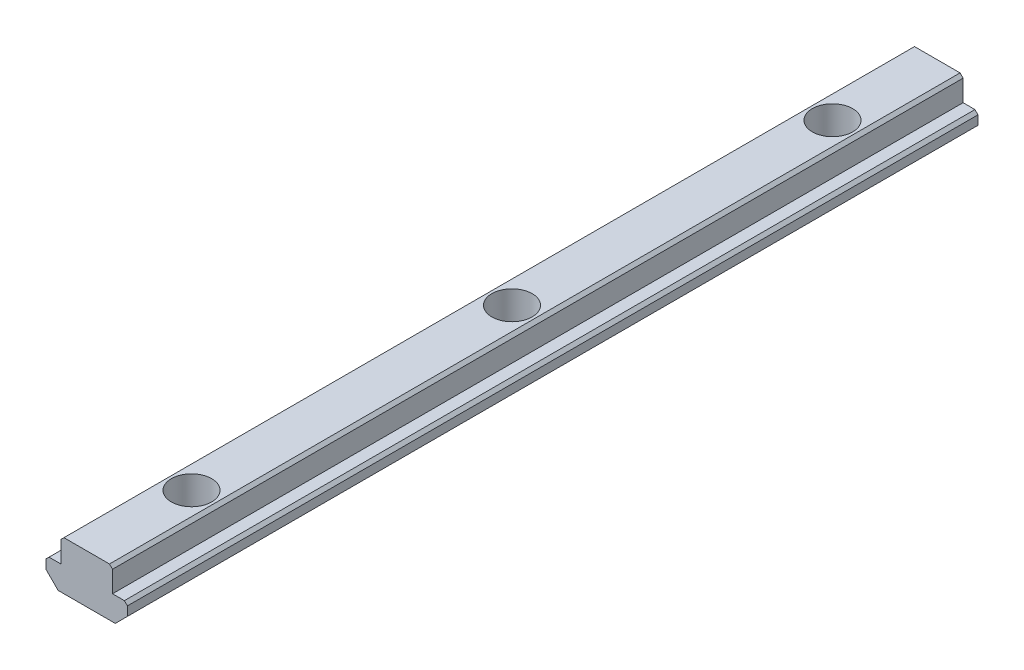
ISO-10303-21;
HEADER;
FILE_DESCRIPTION(('STEP AP214'),'2;1');
FILE_NAME('part.step','',(''),(''),'','','');
FILE_SCHEMA(('AUTOMOTIVE_DESIGN { 1 0 10303 214 1 1 1 1 }'));
ENDSEC;
DATA;
#1=APPLICATION_CONTEXT('core data for automotive mechanical design processes');
#2=APPLICATION_PROTOCOL_DEFINITION('international standard','automotive_design',2000,#1);
#3=PRODUCT_CONTEXT('',#1,'mechanical');
#4=PRODUCT('Part','Part','',(#3));
#5=PRODUCT_RELATED_PRODUCT_CATEGORY('part','',(#4));
#6=PRODUCT_DEFINITION_FORMATION('','',#4);
#7=PRODUCT_DEFINITION_CONTEXT('part definition',#1,'design');
#8=PRODUCT_DEFINITION('design','',#6,#7);
#9=PRODUCT_DEFINITION_SHAPE('','',#8);
#10=(LENGTH_UNIT() NAMED_UNIT(*) SI_UNIT(.MILLI.,.METRE.));
#11=(NAMED_UNIT(*) PLANE_ANGLE_UNIT() SI_UNIT($,.RADIAN.));
#12=(NAMED_UNIT(*) SI_UNIT($,.STERADIAN.) SOLID_ANGLE_UNIT());
#13=UNCERTAINTY_MEASURE_WITH_UNIT(LENGTH_MEASURE(1.E-05),#10,'distance_accuracy_value','');
#14=(GEOMETRIC_REPRESENTATION_CONTEXT(3) GLOBAL_UNCERTAINTY_ASSIGNED_CONTEXT((#13)) GLOBAL_UNIT_ASSIGNED_CONTEXT((#10,
#11,#12)) REPRESENTATION_CONTEXT('',''));
#15=CARTESIAN_POINT('',(0.,0.,0.));
#16=DIRECTION('',(0.,0.,1.));
#17=DIRECTION('',(1.,0.,0.));
#18=AXIS2_PLACEMENT_3D('',#15,#16,#17);
#19=CARTESIAN_POINT('',(-6.7,-0.499999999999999,0.));
#20=DIRECTION('',(-0.707106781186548,0.707106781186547,0.));
#21=DIRECTION('',(-0.707106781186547,-0.707106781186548,0.));
#22=AXIS2_PLACEMENT_3D('',#19,#20,#21);
#23=PLANE('',#22);
#24=DIRECTION('',(-0.707106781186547,-0.707106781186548,0.));
#25=VECTOR('',#24,1.);
#26=CARTESIAN_POINT('',(-6.7,-0.499999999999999,0.));
#27=LINE('',#26,#25);
#28=CARTESIAN_POINT('',(-6.2,0.,0.));
#29=VERTEX_POINT('',#28);
#30=CARTESIAN_POINT('',(-6.7,-0.499999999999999,0.));
#31=VERTEX_POINT('',#30);
#32=EDGE_CURVE('E178',#29,#31,#27,.T.);
#33=ORIENTED_EDGE('',*,*,#32,.T.);
#34=DIRECTION('',(0.,0.,1.));
#35=VECTOR('',#34,1.);
#36=CARTESIAN_POINT('',(-6.7,-0.499999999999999,0.));
#37=LINE('',#36,#35);
#38=CARTESIAN_POINT('',(-6.7,-0.499999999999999,140.));
#39=VERTEX_POINT('',#38);
#40=EDGE_CURVE('E167',#39,#31,#37,.F.);
#41=ORIENTED_EDGE('',*,*,#40,.F.);
#42=DIRECTION('',(-0.707106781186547,-0.707106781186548,0.));
#43=VECTOR('',#42,1.);
#44=CARTESIAN_POINT('',(-6.7,-0.499999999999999,140.));
#45=LINE('',#44,#43);
#46=CARTESIAN_POINT('',(-6.2,0.,140.));
#47=VERTEX_POINT('',#46);
#48=EDGE_CURVE('E181',#39,#47,#45,.F.);
#49=ORIENTED_EDGE('',*,*,#48,.T.);
#50=DIRECTION('',(0.,0.,1.));
#51=VECTOR('',#50,1.);
#52=CARTESIAN_POINT('',(-6.2,0.,0.));
#53=LINE('',#52,#51);
#54=EDGE_CURVE('E162',#29,#47,#53,.T.);
#55=ORIENTED_EDGE('',*,*,#54,.F.);
#56=EDGE_LOOP('',(#33,#41,#49,#55));
#57=FACE_BOUND('',#56,.T.);
#58=ADVANCED_FACE('F15',(#57),#23,.T.);
#59=CARTESIAN_POINT('',(6.2,0.,0.));
#60=DIRECTION('',(0.707106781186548,0.707106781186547,0.));
#61=DIRECTION('',(-0.707106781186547,0.707106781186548,0.));
#62=AXIS2_PLACEMENT_3D('',#59,#60,#61);
#63=PLANE('',#62);
#64=DIRECTION('',(-0.707106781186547,0.707106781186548,0.));
#65=VECTOR('',#64,1.);
#66=CARTESIAN_POINT('',(6.2,0.,0.));
#67=LINE('',#66,#65);
#68=CARTESIAN_POINT('',(6.7,-0.500000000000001,0.));
#69=VERTEX_POINT('',#68);
#70=CARTESIAN_POINT('',(6.2,0.,0.));
#71=VERTEX_POINT('',#70);
#72=EDGE_CURVE('E174',#69,#71,#67,.T.);
#73=ORIENTED_EDGE('',*,*,#72,.T.);
#74=DIRECTION('',(0.,0.,1.));
#75=VECTOR('',#74,1.);
#76=CARTESIAN_POINT('',(6.2,0.,0.));
#77=LINE('',#76,#75);
#78=CARTESIAN_POINT('',(6.2,0.,140.));
#79=VERTEX_POINT('',#78);
#80=EDGE_CURVE('E159',#79,#71,#77,.F.);
#81=ORIENTED_EDGE('',*,*,#80,.F.);
#82=DIRECTION('',(-0.707106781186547,0.707106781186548,0.));
#83=VECTOR('',#82,1.);
#84=CARTESIAN_POINT('',(6.2,0.,140.));
#85=LINE('',#84,#83);
#86=CARTESIAN_POINT('',(6.7,-0.500000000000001,140.));
#87=VERTEX_POINT('',#86);
#88=EDGE_CURVE('E176',#79,#87,#85,.F.);
#89=ORIENTED_EDGE('',*,*,#88,.T.);
#90=DIRECTION('',(0.,0.,-1.));
#91=VECTOR('',#90,1.);
#92=CARTESIAN_POINT('',(6.7,-0.500000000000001,0.));
#93=LINE('',#92,#91);
#94=EDGE_CURVE('E150',#69,#87,#93,.F.);
#95=ORIENTED_EDGE('',*,*,#94,.F.);
#96=EDGE_LOOP('',(#73,#81,#89,#95));
#97=FACE_BOUND('',#96,.T.);
#98=ADVANCED_FACE('F289',(#97),#63,.T.);
#99=CARTESIAN_POINT('',(3.75,4.,0.));
#100=DIRECTION('',(0.707106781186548,0.707106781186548,0.));
#101=DIRECTION('',(-0.707106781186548,0.707106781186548,0.));
#102=AXIS2_PLACEMENT_3D('',#99,#100,#101);
#103=PLANE('',#102);
#104=DIRECTION('',(-0.707106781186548,0.707106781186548,0.));
#105=VECTOR('',#104,1.);
#106=CARTESIAN_POINT('',(3.75,4.,0.));
#107=LINE('',#106,#105);
#108=CARTESIAN_POINT('',(4.25,3.5,0.));
#109=VERTEX_POINT('',#108);
#110=CARTESIAN_POINT('',(3.75,4.,0.));
#111=VERTEX_POINT('',#110);
#112=EDGE_CURVE('E126',#109,#111,#107,.T.);
#113=ORIENTED_EDGE('',*,*,#112,.T.);
#114=DIRECTION('',(0.,0.,1.));
#115=VECTOR('',#114,1.);
#116=CARTESIAN_POINT('',(3.75,4.,0.));
#117=LINE('',#116,#115);
#118=CARTESIAN_POINT('',(3.75,4.,140.));
#119=VERTEX_POINT('',#118);
#120=EDGE_CURVE('E144',#119,#111,#117,.F.);
#121=ORIENTED_EDGE('',*,*,#120,.F.);
#122=DIRECTION('',(-0.707106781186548,0.707106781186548,0.));
#123=VECTOR('',#122,1.);
#124=CARTESIAN_POINT('',(3.75,4.,140.));
#125=LINE('',#124,#123);
#126=CARTESIAN_POINT('',(4.25,3.5,140.));
#127=VERTEX_POINT('',#126);
#128=EDGE_CURVE('E172',#119,#127,#125,.F.);
#129=ORIENTED_EDGE('',*,*,#128,.T.);
#130=DIRECTION('',(0.,0.,-1.));
#131=VECTOR('',#130,1.);
#132=CARTESIAN_POINT('',(4.25,3.5,0.));
#133=LINE('',#132,#131);
#134=EDGE_CURVE('E135',#109,#127,#133,.F.);
#135=ORIENTED_EDGE('',*,*,#134,.F.);
#136=EDGE_LOOP('',(#113,#121,#129,#135));
#137=FACE_BOUND('',#136,.T.);
#138=ADVANCED_FACE('F277',(#137),#103,.T.);
#139=CARTESIAN_POINT('',(-4.24999999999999,3.5,0.));
#140=DIRECTION('',(-0.707106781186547,0.707106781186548,0.));
#141=DIRECTION('',(-0.707106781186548,-0.707106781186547,0.));
#142=AXIS2_PLACEMENT_3D('',#139,#140,#141);
#143=PLANE('',#142);
#144=DIRECTION('',(-0.707106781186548,-0.707106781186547,0.));
#145=VECTOR('',#144,1.);
#146=CARTESIAN_POINT('',(-4.24999999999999,3.5,0.));
#147=LINE('',#146,#145);
#148=CARTESIAN_POINT('',(-3.74999999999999,4.,0.));
#149=VERTEX_POINT('',#148);
#150=CARTESIAN_POINT('',(-4.24999999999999,3.5,0.));
#151=VERTEX_POINT('',#150);
#152=EDGE_CURVE('E125',#149,#151,#147,.T.);
#153=ORIENTED_EDGE('',*,*,#152,.T.);
#154=DIRECTION('',(0.,0.,1.));
#155=VECTOR('',#154,1.);
#156=CARTESIAN_POINT('',(-4.24999999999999,3.5,0.));
#157=LINE('',#156,#155);
#158=CARTESIAN_POINT('',(-4.24999999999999,3.5,140.));
#159=VERTEX_POINT('',#158);
#160=EDGE_CURVE('E129',#159,#151,#157,.F.);
#161=ORIENTED_EDGE('',*,*,#160,.F.);
#162=DIRECTION('',(-0.707106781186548,-0.707106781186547,0.));
#163=VECTOR('',#162,1.);
#164=CARTESIAN_POINT('',(-4.24999999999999,3.5,140.));
#165=LINE('',#164,#163);
#166=CARTESIAN_POINT('',(-3.74999999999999,4.,140.));
#167=VERTEX_POINT('',#166);
#168=EDGE_CURVE('E114',#159,#167,#165,.F.);
#169=ORIENTED_EDGE('',*,*,#168,.T.);
#170=DIRECTION('',(0.,0.,1.));
#171=VECTOR('',#170,1.);
#172=CARTESIAN_POINT('',(-3.74999999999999,4.,0.));
#173=LINE('',#172,#171);
#174=EDGE_CURVE('E140',#149,#167,#173,.T.);
#175=ORIENTED_EDGE('',*,*,#174,.F.);
#176=EDGE_LOOP('',(#153,#161,#169,#175));
#177=FACE_BOUND('',#176,.T.);
#178=ADVANCED_FACE('F130',(#177),#143,.T.);
#179=CARTESIAN_POINT('',(-6.7,-2.,0.));
#180=DIRECTION('',(-1.,0.,0.));
#181=DIRECTION('',(0.,0.,1.));
#182=AXIS2_PLACEMENT_3D('',#179,#180,#181);
#183=PLANE('',#182);
#184=DIRECTION('',(0.,1.,0.));
#185=VECTOR('',#184,1.);
#186=CARTESIAN_POINT('',(-6.7,-2.,0.));
#187=LINE('',#186,#185);
#188=CARTESIAN_POINT('',(-6.7,-2.,0.));
#189=VERTEX_POINT('',#188);
#190=EDGE_CURVE('E165',#31,#189,#187,.F.);
#191=ORIENTED_EDGE('',*,*,#190,.T.);
#192=DIRECTION('',(0.,0.,1.));
#193=VECTOR('',#192,1.);
#194=CARTESIAN_POINT('',(-6.7,-2.,0.));
#195=LINE('',#194,#193);
#196=CARTESIAN_POINT('',(-6.7,-2.,140.));
#197=VERTEX_POINT('',#196);
#198=EDGE_CURVE('E229',#197,#189,#195,.F.);
#199=ORIENTED_EDGE('',*,*,#198,.F.);
#200=DIRECTION('',(0.,1.,0.));
#201=VECTOR('',#200,1.);
#202=CARTESIAN_POINT('',(-6.7,-0.2830784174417,140.));
#203=LINE('',#202,#201);
#204=EDGE_CURVE('E142',#39,#197,#203,.F.);
#205=ORIENTED_EDGE('',*,*,#204,.F.);
#206=ORIENTED_EDGE('',*,*,#40,.T.);
#207=EDGE_LOOP('',(#191,#199,#205,#206));
#208=FACE_BOUND('',#207,.T.);
#209=ADVANCED_FACE('F249',(#208),#183,.T.);
#210=CARTESIAN_POINT('',(-6.2,0.,0.));
#211=DIRECTION('',(0.,1.,0.));
#212=DIRECTION('',(0.,0.,1.));
#213=AXIS2_PLACEMENT_3D('',#210,#211,#212);
#214=PLANE('',#213);
#215=DIRECTION('',(1.,0.,0.));
#216=VECTOR('',#215,1.);
#217=CARTESIAN_POINT('',(0.,0.,0.));
#218=LINE('',#217,#216);
#219=CARTESIAN_POINT('',(-4.24999999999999,0.,0.));
#220=VERTEX_POINT('',#219);
#221=EDGE_CURVE('E226',#220,#29,#218,.F.);
#222=ORIENTED_EDGE('',*,*,#221,.T.);
#223=ORIENTED_EDGE('',*,*,#54,.T.);
#224=DIRECTION('',(1.,0.,0.));
#225=VECTOR('',#224,1.);
#226=CARTESIAN_POINT('',(0.,0.,140.));
#227=LINE('',#226,#225);
#228=CARTESIAN_POINT('',(-4.24999999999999,0.,140.));
#229=VERTEX_POINT('',#228);
#230=EDGE_CURVE('E139',#229,#47,#227,.F.);
#231=ORIENTED_EDGE('',*,*,#230,.F.);
#232=DIRECTION('',(0.,0.,1.));
#233=VECTOR('',#232,1.);
#234=CARTESIAN_POINT('',(-4.24999999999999,0.,0.));
#235=LINE('',#234,#233);
#236=EDGE_CURVE('E134',#220,#229,#235,.T.);
#237=ORIENTED_EDGE('',*,*,#236,.F.);
#238=EDGE_LOOP('',(#222,#223,#231,#237));
#239=FACE_BOUND('',#238,.T.);
#240=ADVANCED_FACE('F271',(#239),#214,.T.);
#241=CARTESIAN_POINT('',(4.25,0.,0.));
#242=DIRECTION('',(0.,1.,0.));
#243=DIRECTION('',(0.,0.,1.));
#244=AXIS2_PLACEMENT_3D('',#241,#242,#243);
#245=PLANE('',#244);
#246=DIRECTION('',(1.,0.,0.));
#247=VECTOR('',#246,1.);
#248=CARTESIAN_POINT('',(0.,0.,0.));
#249=LINE('',#248,#247);
#250=CARTESIAN_POINT('',(4.25,0.,0.));
#251=VERTEX_POINT('',#250);
#252=EDGE_CURVE('E219',#71,#251,#249,.F.);
#253=ORIENTED_EDGE('',*,*,#252,.T.);
#254=DIRECTION('',(0.,0.,-1.));
#255=VECTOR('',#254,1.);
#256=CARTESIAN_POINT('',(4.25,0.,0.));
#257=LINE('',#256,#255);
#258=CARTESIAN_POINT('',(4.25,0.,140.));
#259=VERTEX_POINT('',#258);
#260=EDGE_CURVE('E156',#259,#251,#257,.T.);
#261=ORIENTED_EDGE('',*,*,#260,.F.);
#262=DIRECTION('',(1.,0.,0.));
#263=VECTOR('',#262,1.);
#264=CARTESIAN_POINT('',(0.,0.,140.));
#265=LINE('',#264,#263);
#266=EDGE_CURVE('E239',#79,#259,#265,.F.);
#267=ORIENTED_EDGE('',*,*,#266,.F.);
#268=ORIENTED_EDGE('',*,*,#80,.T.);
#269=EDGE_LOOP('',(#253,#261,#267,#268));
#270=FACE_BOUND('',#269,.T.);
#271=ADVANCED_FACE('F286',(#270),#245,.T.);
#272=CARTESIAN_POINT('',(4.25,3.5,0.));
#273=DIRECTION('',(1.,0.,0.));
#274=DIRECTION('',(0.,0.,-1.));
#275=AXIS2_PLACEMENT_3D('',#272,#273,#274);
#276=PLANE('',#275);
#277=DIRECTION('',(0.,1.,0.));
#278=VECTOR('',#277,1.);
#279=CARTESIAN_POINT('',(4.25,-0.2830784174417,0.));
#280=LINE('',#279,#278);
#281=EDGE_CURVE('E216',#251,#109,#280,.T.);
#282=ORIENTED_EDGE('',*,*,#281,.T.);
#283=ORIENTED_EDGE('',*,*,#134,.T.);
#284=DIRECTION('',(0.,1.,0.));
#285=VECTOR('',#284,1.);
#286=CARTESIAN_POINT('',(4.25,-0.2830784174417,140.));
#287=LINE('',#286,#285);
#288=EDGE_CURVE('E236',#259,#127,#287,.T.);
#289=ORIENTED_EDGE('',*,*,#288,.F.);
#290=ORIENTED_EDGE('',*,*,#260,.T.);
#291=EDGE_LOOP('',(#282,#283,#289,#290));
#292=FACE_BOUND('',#291,.T.);
#293=ADVANCED_FACE('F282',(#292),#276,.T.);
#294=CARTESIAN_POINT('',(-4.24999999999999,0.,0.));
#295=DIRECTION('',(-1.,0.,0.));
#296=DIRECTION('',(0.,0.,1.));
#297=AXIS2_PLACEMENT_3D('',#294,#295,#296);
#298=PLANE('',#297);
#299=DIRECTION('',(0.,1.,0.));
#300=VECTOR('',#299,1.);
#301=CARTESIAN_POINT('',(-4.24999999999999,-0.2830784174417,0.));
#302=LINE('',#301,#300);
#303=EDGE_CURVE('E211',#151,#220,#302,.F.);
#304=ORIENTED_EDGE('',*,*,#303,.T.);
#305=ORIENTED_EDGE('',*,*,#236,.T.);
#306=DIRECTION('',(0.,1.,0.));
#307=VECTOR('',#306,1.);
#308=CARTESIAN_POINT('',(-4.24999999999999,-0.2830784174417,140.));
#309=LINE('',#308,#307);
#310=EDGE_CURVE('E119',#159,#229,#309,.F.);
#311=ORIENTED_EDGE('',*,*,#310,.F.);
#312=ORIENTED_EDGE('',*,*,#160,.T.);
#313=EDGE_LOOP('',(#304,#305,#311,#312));
#314=FACE_BOUND('',#313,.T.);
#315=ADVANCED_FACE('F137',(#314),#298,.T.);
#316=CARTESIAN_POINT('',(6.7,-0.500000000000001,0.));
#317=DIRECTION('',(1.,0.,0.));
#318=DIRECTION('',(0.,0.,-1.));
#319=AXIS2_PLACEMENT_3D('',#316,#317,#318);
#320=PLANE('',#319);
#321=DIRECTION('',(0.,1.,0.));
#322=VECTOR('',#321,1.);
#323=CARTESIAN_POINT('',(6.7,-0.2830784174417,0.));
#324=LINE('',#323,#322);
#325=CARTESIAN_POINT('',(6.7,-2.,0.));
#326=VERTEX_POINT('',#325);
#327=EDGE_CURVE('E221',#326,#69,#324,.T.);
#328=ORIENTED_EDGE('',*,*,#327,.T.);
#329=ORIENTED_EDGE('',*,*,#94,.T.);
#330=DIRECTION('',(0.,1.,0.));
#331=VECTOR('',#330,1.);
#332=CARTESIAN_POINT('',(6.7,-0.2830784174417,140.));
#333=LINE('',#332,#331);
#334=CARTESIAN_POINT('',(6.7,-2.,140.));
#335=VERTEX_POINT('',#334);
#336=EDGE_CURVE('E242',#335,#87,#333,.T.);
#337=ORIENTED_EDGE('',*,*,#336,.F.);
#338=DIRECTION('',(0.,0.,1.));
#339=VECTOR('',#338,1.);
#340=CARTESIAN_POINT('',(6.7,-2.,0.));
#341=LINE('',#340,#339);
#342=EDGE_CURVE('E197',#326,#335,#341,.T.);
#343=ORIENTED_EDGE('',*,*,#342,.F.);
#344=EDGE_LOOP('',(#328,#329,#337,#343));
#345=FACE_BOUND('',#344,.T.);
#346=ADVANCED_FACE('F292',(#345),#320,.T.);
#347=CARTESIAN_POINT('',(-3.74999999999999,4.,0.));
#348=DIRECTION('',(0.,1.,0.));
#349=DIRECTION('',(0.,0.,1.));
#350=AXIS2_PLACEMENT_3D('',#347,#348,#349);
#351=PLANE('',#350);
#352=CARTESIAN_POINT('',(0.,4.,17.25));
#353=DIRECTION('',(0.,-1.,0.));
#354=DIRECTION('',(0.,0.,-1.));
#355=AXIS2_PLACEMENT_3D('',#352,#353,#354);
#356=CIRCLE('',#355,3.3235);
#357=CARTESIAN_POINT('',(0.,4.,13.9265));
#358=VERTEX_POINT('',#357);
#359=EDGE_CURVE('E189',#358,#358,#356,.T.);
#360=ORIENTED_EDGE('',*,*,#359,.T.);
#361=EDGE_LOOP('',(#360));
#362=FACE_BOUND('',#361,.T.);
#363=CARTESIAN_POINT('',(0.,4.,122.75));
#364=DIRECTION('',(0.,-1.,0.));
#365=DIRECTION('',(0.,0.,-1.));
#366=AXIS2_PLACEMENT_3D('',#363,#364,#365);
#367=CIRCLE('',#366,3.3235);
#368=CARTESIAN_POINT('',(0.,4.,119.4265));
#369=VERTEX_POINT('',#368);
#370=EDGE_CURVE('E192',#369,#369,#367,.T.);
#371=ORIENTED_EDGE('',*,*,#370,.T.);
#372=EDGE_LOOP('',(#371));
#373=FACE_BOUND('',#372,.T.);
#374=CARTESIAN_POINT('',(0.,4.,70.));
#375=DIRECTION('',(0.,-1.,0.));
#376=DIRECTION('',(0.,0.,-1.));
#377=AXIS2_PLACEMENT_3D('',#374,#375,#376);
#378=CIRCLE('',#377,3.3235);
#379=CARTESIAN_POINT('',(0.,4.,66.6765));
#380=VERTEX_POINT('',#379);
#381=EDGE_CURVE('E19',#380,#380,#378,.T.);
#382=ORIENTED_EDGE('',*,*,#381,.T.);
#383=EDGE_LOOP('',(#382));
#384=FACE_BOUND('',#383,.T.);
#385=DIRECTION('',(1.,0.,0.));
#386=VECTOR('',#385,1.);
#387=CARTESIAN_POINT('',(0.,4.,0.));
#388=LINE('',#387,#386);
#389=EDGE_CURVE('E213',#111,#149,#388,.F.);
#390=ORIENTED_EDGE('',*,*,#389,.T.);
#391=ORIENTED_EDGE('',*,*,#174,.T.);
#392=DIRECTION('',(1.,0.,0.));
#393=VECTOR('',#392,1.);
#394=CARTESIAN_POINT('',(0.,4.,140.));
#395=LINE('',#394,#393);
#396=EDGE_CURVE('E121',#119,#167,#395,.F.);
#397=ORIENTED_EDGE('',*,*,#396,.F.);
#398=ORIENTED_EDGE('',*,*,#120,.T.);
#399=EDGE_LOOP('',(#390,#391,#397,#398));
#400=FACE_BOUND('',#399,.T.);
#401=ADVANCED_FACE('F274',(#362,#373,#384,#400),#351,.T.);
#402=CARTESIAN_POINT('',(0.,-0.2830784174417,140.));
#403=DIRECTION('',(0.,0.,1.));
#404=DIRECTION('',(1.,0.,0.));
#405=AXIS2_PLACEMENT_3D('',#402,#403,#404);
#406=PLANE('',#405);
#407=ORIENTED_EDGE('',*,*,#128,.F.);
#408=ORIENTED_EDGE('',*,*,#396,.T.);
#409=ORIENTED_EDGE('',*,*,#168,.F.);
#410=ORIENTED_EDGE('',*,*,#310,.T.);
#411=ORIENTED_EDGE('',*,*,#230,.T.);
#412=ORIENTED_EDGE('',*,*,#48,.F.);
#413=ORIENTED_EDGE('',*,*,#204,.T.);
#414=DIRECTION('',(0.707106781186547,-0.707106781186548,0.));
#415=VECTOR('',#414,1.);
#416=CARTESIAN_POINT('',(-4.7,-4.,140.));
#417=LINE('',#416,#415);
#418=CARTESIAN_POINT('',(-4.7,-4.,140.));
#419=VERTEX_POINT('',#418);
#420=EDGE_CURVE('E232',#419,#197,#417,.F.);
#421=ORIENTED_EDGE('',*,*,#420,.F.);
#422=DIRECTION('',(1.,0.,0.));
#423=VECTOR('',#422,1.);
#424=CARTESIAN_POINT('',(4.7,-4.,140.));
#425=LINE('',#424,#423);
#426=CARTESIAN_POINT('',(4.7,-4.,140.));
#427=VERTEX_POINT('',#426);
#428=EDGE_CURVE('E191',#427,#419,#425,.F.);
#429=ORIENTED_EDGE('',*,*,#428,.F.);
#430=DIRECTION('',(0.707106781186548,0.707106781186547,0.));
#431=VECTOR('',#430,1.);
#432=CARTESIAN_POINT('',(6.7,-2.,140.));
#433=LINE('',#432,#431);
#434=EDGE_CURVE('E205',#335,#427,#433,.F.);
#435=ORIENTED_EDGE('',*,*,#434,.F.);
#436=ORIENTED_EDGE('',*,*,#336,.T.);
#437=ORIENTED_EDGE('',*,*,#88,.F.);
#438=ORIENTED_EDGE('',*,*,#266,.T.);
#439=ORIENTED_EDGE('',*,*,#288,.T.);
#440=EDGE_LOOP('',(#407,#408,#409,#410,#411,#412,#413,#421,#429,#435,#436,#437,#438,#439));
#441=FACE_BOUND('',#440,.T.);
#442=ADVANCED_FACE('F116',(#441),#406,.T.);
#443=CARTESIAN_POINT('',(-4.7,-4.,0.));
#444=DIRECTION('',(-0.707106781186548,-0.707106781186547,0.));
#445=DIRECTION('',(0.707106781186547,-0.707106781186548,0.));
#446=AXIS2_PLACEMENT_3D('',#443,#444,#445);
#447=PLANE('',#446);
#448=DIRECTION('',(0.707106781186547,-0.707106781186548,0.));
#449=VECTOR('',#448,1.);
#450=CARTESIAN_POINT('',(-6.7,-2.,0.));
#451=LINE('',#450,#449);
#452=CARTESIAN_POINT('',(-4.7,-4.,0.));
#453=VERTEX_POINT('',#452);
#454=EDGE_CURVE('E224',#189,#453,#451,.T.);
#455=ORIENTED_EDGE('',*,*,#454,.T.);
#456=DIRECTION('',(0.,0.,-1.));
#457=VECTOR('',#456,1.);
#458=CARTESIAN_POINT('',(-4.7,-4.,0.));
#459=LINE('',#458,#457);
#460=EDGE_CURVE('E255',#419,#453,#459,.T.);
#461=ORIENTED_EDGE('',*,*,#460,.F.);
#462=ORIENTED_EDGE('',*,*,#420,.T.);
#463=ORIENTED_EDGE('',*,*,#198,.T.);
#464=EDGE_LOOP('',(#455,#461,#462,#463));
#465=FACE_BOUND('',#464,.T.);
#466=ADVANCED_FACE('F253',(#465),#447,.T.);
#467=CARTESIAN_POINT('',(0.,-0.2830784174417,0.));
#468=DIRECTION('',(0.,0.,1.));
#469=DIRECTION('',(1.,0.,0.));
#470=AXIS2_PLACEMENT_3D('',#467,#468,#469);
#471=PLANE('',#470);
#472=ORIENTED_EDGE('',*,*,#152,.F.);
#473=ORIENTED_EDGE('',*,*,#389,.F.);
#474=ORIENTED_EDGE('',*,*,#112,.F.);
#475=ORIENTED_EDGE('',*,*,#281,.F.);
#476=ORIENTED_EDGE('',*,*,#252,.F.);
#477=ORIENTED_EDGE('',*,*,#72,.F.);
#478=ORIENTED_EDGE('',*,*,#327,.F.);
#479=DIRECTION('',(0.707106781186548,0.707106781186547,0.));
#480=VECTOR('',#479,1.);
#481=CARTESIAN_POINT('',(6.7,-2.,0.));
#482=LINE('',#481,#480);
#483=CARTESIAN_POINT('',(4.7,-4.,0.));
#484=VERTEX_POINT('',#483);
#485=EDGE_CURVE('E34',#484,#326,#482,.T.);
#486=ORIENTED_EDGE('',*,*,#485,.F.);
#487=DIRECTION('',(1.,0.,0.));
#488=VECTOR('',#487,1.);
#489=CARTESIAN_POINT('',(4.7,-4.,0.));
#490=LINE('',#489,#488);
#491=EDGE_CURVE('E259',#453,#484,#490,.T.);
#492=ORIENTED_EDGE('',*,*,#491,.F.);
#493=ORIENTED_EDGE('',*,*,#454,.F.);
#494=ORIENTED_EDGE('',*,*,#190,.F.);
#495=ORIENTED_EDGE('',*,*,#32,.F.);
#496=ORIENTED_EDGE('',*,*,#221,.F.);
#497=ORIENTED_EDGE('',*,*,#303,.F.);
#498=EDGE_LOOP('',(#472,#473,#474,#475,#476,#477,#478,#486,#492,#493,#494,#495,#496,#497));
#499=FACE_BOUND('',#498,.T.);
#500=ADVANCED_FACE('F266',(#499),#471,.F.);
#501=CARTESIAN_POINT('',(6.7,-2.,0.));
#502=DIRECTION('',(0.707106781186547,-0.707106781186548,0.));
#503=DIRECTION('',(0.707106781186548,0.707106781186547,0.));
#504=AXIS2_PLACEMENT_3D('',#501,#502,#503);
#505=PLANE('',#504);
#506=ORIENTED_EDGE('',*,*,#485,.T.);
#507=ORIENTED_EDGE('',*,*,#342,.T.);
#508=ORIENTED_EDGE('',*,*,#434,.T.);
#509=DIRECTION('',(0.,0.,-1.));
#510=VECTOR('',#509,1.);
#511=CARTESIAN_POINT('',(4.7,-4.,0.));
#512=LINE('',#511,#510);
#513=EDGE_CURVE('E188',#484,#427,#512,.F.);
#514=ORIENTED_EDGE('',*,*,#513,.F.);
#515=EDGE_LOOP('',(#506,#507,#508,#514));
#516=FACE_BOUND('',#515,.T.);
#517=ADVANCED_FACE('F263',(#516),#505,.T.);
#518=CARTESIAN_POINT('',(0.,4.,70.));
#519=DIRECTION('',(0.,-1.,0.));
#520=DIRECTION('',(0.,0.,-1.));
#521=AXIS2_PLACEMENT_3D('',#518,#519,#520);
#522=CYLINDRICAL_SURFACE('',#521,3.3235);
#523=ORIENTED_EDGE('',*,*,#381,.F.);
#524=EDGE_LOOP('',(#523));
#525=FACE_BOUND('',#524,.T.);
#526=CARTESIAN_POINT('',(0.,-4.,70.));
#527=DIRECTION('',(0.,-1.,0.));
#528=DIRECTION('',(0.,0.,-1.));
#529=AXIS2_PLACEMENT_3D('',#526,#527,#528);
#530=CIRCLE('',#529,3.3235);
#531=CARTESIAN_POINT('',(0.,-4.,66.6765));
#532=VERTEX_POINT('',#531);
#533=EDGE_CURVE('E185',#532,#532,#530,.F.);
#534=ORIENTED_EDGE('',*,*,#533,.F.);
#535=EDGE_LOOP('',(#534));
#536=FACE_BOUND('',#535,.T.);
#537=ADVANCED_FACE('F315',(#525,#536),#522,.F.);
#538=CARTESIAN_POINT('',(0.,4.,122.75));
#539=DIRECTION('',(0.,-1.,0.));
#540=DIRECTION('',(0.,0.,-1.));
#541=AXIS2_PLACEMENT_3D('',#538,#539,#540);
#542=CYLINDRICAL_SURFACE('',#541,3.3235);
#543=ORIENTED_EDGE('',*,*,#370,.F.);
#544=EDGE_LOOP('',(#543));
#545=FACE_BOUND('',#544,.T.);
#546=CARTESIAN_POINT('',(0.,-4.,122.75));
#547=DIRECTION('',(0.,-1.,0.));
#548=DIRECTION('',(0.,0.,-1.));
#549=AXIS2_PLACEMENT_3D('',#546,#547,#548);
#550=CIRCLE('',#549,3.3235);
#551=CARTESIAN_POINT('',(0.,-4.,119.4265));
#552=VERTEX_POINT('',#551);
#553=EDGE_CURVE('E25',#552,#552,#550,.F.);
#554=ORIENTED_EDGE('',*,*,#553,.F.);
#555=EDGE_LOOP('',(#554));
#556=FACE_BOUND('',#555,.T.);
#557=ADVANCED_FACE('F309',(#545,#556),#542,.F.);
#558=CARTESIAN_POINT('',(0.,4.,17.25));
#559=DIRECTION('',(0.,-1.,0.));
#560=DIRECTION('',(0.,0.,-1.));
#561=AXIS2_PLACEMENT_3D('',#558,#559,#560);
#562=CYLINDRICAL_SURFACE('',#561,3.3235);
#563=ORIENTED_EDGE('',*,*,#359,.F.);
#564=EDGE_LOOP('',(#563));
#565=FACE_BOUND('',#564,.T.);
#566=CARTESIAN_POINT('',(0.,-4.,17.25));
#567=DIRECTION('',(0.,-1.,0.));
#568=DIRECTION('',(0.,0.,-1.));
#569=AXIS2_PLACEMENT_3D('',#566,#567,#568);
#570=CIRCLE('',#569,3.3235);
#571=CARTESIAN_POINT('',(0.,-4.,13.9265));
#572=VERTEX_POINT('',#571);
#573=EDGE_CURVE('E10',#572,#572,#570,.F.);
#574=ORIENTED_EDGE('',*,*,#573,.F.);
#575=EDGE_LOOP('',(#574));
#576=FACE_BOUND('',#575,.T.);
#577=ADVANCED_FACE('F17',(#565,#576),#562,.F.);
#578=CARTESIAN_POINT('',(4.7,-4.,0.));
#579=DIRECTION('',(0.,-1.,0.));
#580=DIRECTION('',(0.,0.,-1.));
#581=AXIS2_PLACEMENT_3D('',#578,#579,#580);
#582=PLANE('',#581);
#583=ORIENTED_EDGE('',*,*,#573,.T.);
#584=EDGE_LOOP('',(#583));
#585=FACE_BOUND('',#584,.T.);
#586=ORIENTED_EDGE('',*,*,#553,.T.);
#587=EDGE_LOOP('',(#586));
#588=FACE_BOUND('',#587,.T.);
#589=ORIENTED_EDGE('',*,*,#533,.T.);
#590=EDGE_LOOP('',(#589));
#591=FACE_BOUND('',#590,.T.);
#592=ORIENTED_EDGE('',*,*,#491,.T.);
#593=ORIENTED_EDGE('',*,*,#513,.T.);
#594=ORIENTED_EDGE('',*,*,#428,.T.);
#595=ORIENTED_EDGE('',*,*,#460,.T.);
#596=EDGE_LOOP('',(#592,#593,#594,#595));
#597=FACE_BOUND('',#596,.T.);
#598=ADVANCED_FACE('F261',(#585,#588,#591,#597),#582,.T.);
#599=CLOSED_SHELL('',(#58,#98,#138,#178,#209,#240,#271,#293,#315,#346,#401,#442,#466,#500,#517,
#537,#557,#577,#598));
#600=MANIFOLD_SOLID_BREP('B1',#599);
#601=ADVANCED_BREP_SHAPE_REPRESENTATION('',(#18,#600),#14);
#602=SHAPE_DEFINITION_REPRESENTATION(#9,#601);
ENDSEC;
END-ISO-10303-21;
